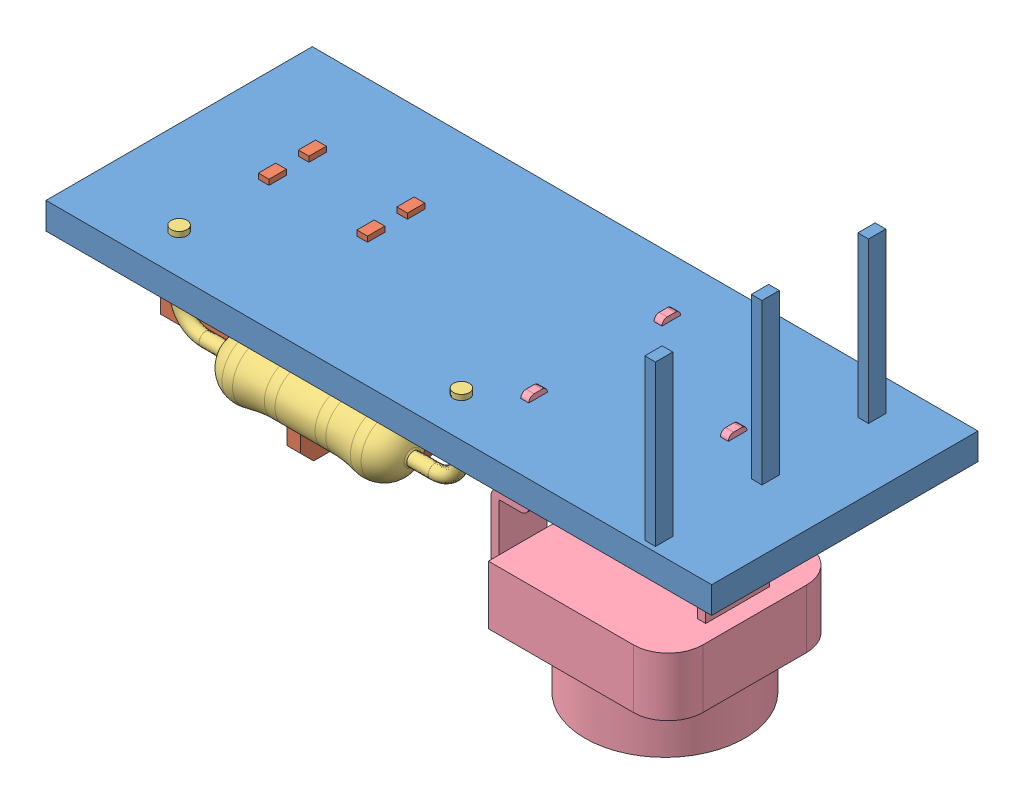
SolidWorks assembly backIRs.SLDASM, configuration Default (file format 9000). Lengths in mm.
Overall size (25 15.7 10).
4 component instances, 4 part files, 9 mates.
Components (placement in the parent):
- backIRsensorplate-1: backIRsensorplate.SLDPRT [Default] at (14.5803 8.504 12.571) size (25 7 10)
- TCR5000-1: TCR5000.SLDPRT [Default] at (7.4303 8.504 11.821) x (0 0 -1) z (0 -1 0) size (5.6 10 8.1)
- ohm resistance-1: ohm resistance.SLDPRT [Default] at (10.8803 6.504 16.071) x (1 0 0) z (0 0 -1) size (11.2 4.3 2.2)
- Pot - RES_VAR1-1: Pot - RES_VAR1.SLDPRT [Default] at (19.9953 1.804 12.246) x (0 0 1) z (1 0 0) size (6.5 9.9 7.05)
Mates (geometry in assembly coordinates):
- Coincident1: coincident anti-aligned: plane of backIRsensorplate-1 through (14.5803 8.504 12.571) normal (0 -1 0); plane of TCR5000-1 through (2.4303 8.504 9.021) normal (0 1 0)
- Coincident2: coincident anti-aligned: plane of backIRsensorplate-1 through (5.3803 9.504 12.896) normal (0 0 -1); plane of TCR5000-1 through (5.7803 9.704 12.896) normal (0 0 1)
- Coincident3: coincident anti-aligned: plane of backIRsensorplate-1 through (5.3803 9.504 12.246) normal (1 0 0); plane of TCR5000-1 through (5.3803 9.704 12.896) normal (-1 0 0)
- Coincident4: coincident anti-aligned: plane of backIRsensorplate-1 through (14.5803 9.504 12.571) normal (0 1 0); plane of ohm resistance-1 through (5.5803 9.504 16.071) normal (0 -1 0)
- Concentric1: concentric anti-aligned: cylinder of backIRsensorplate-1 through (5.5803 9.504 16.071) axis (0 -1 0) radius 0.25; cylinder of ohm resistance-1 through (5.5803 7.504 16.071) axis (0 1 0) radius 0.25
- Concentric2: concentric anti-aligned: cylinder of backIRsensorplate-1 through (16.1803 9.504 16.071) axis (0 -1 0) radius 0.25; cylinder of ohm resistance-1 through (16.1803 7.504 16.071) axis (0 1 0) radius 0.25
- Coincident5: coincident: plane of backIRsensorplate-1 through (14.5803 9.504 12.571) normal (0 1 0); line of Pot - RES_VAR1-1 through (22.4303 9.504 11.896) axis (1 0 0)
- Coincident6: coincident anti-aligned: plane of backIRsensorplate-1 through (22.4303 9.504 12.596) normal (0 0 -1); plane of Pot - RES_VAR1-1 through (22.4303 9.704 12.596) normal (0 0 1)
- Coincident7: coincident anti-aligned: plane of backIRsensorplate-1 through (22.7303 9.504 11.896) normal (-1 0 0); plane of Pot - RES_VAR1-1 through (22.7303 7.204 11.046) normal (1 0 0)
